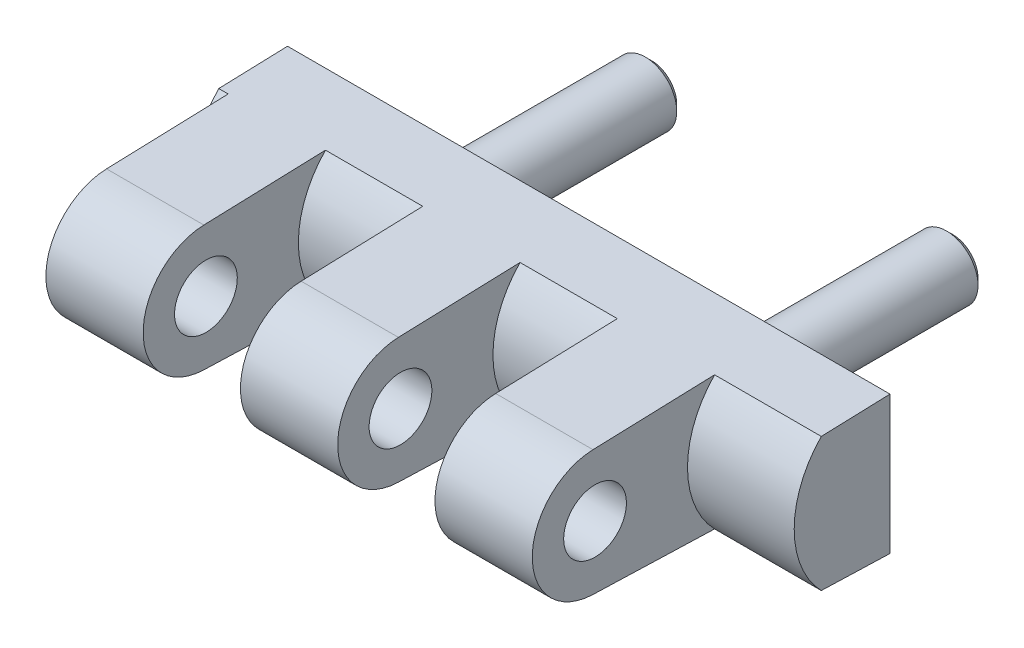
ISO-10303-21;
HEADER;
FILE_DESCRIPTION(('STEP AP214'),'2;1');
FILE_NAME('part.step','',(''),(''),'','','');
FILE_SCHEMA(('AUTOMOTIVE_DESIGN { 1 0 10303 214 1 1 1 1 }'));
ENDSEC;
DATA;
#1=APPLICATION_CONTEXT('core data for automotive mechanical design processes');
#2=APPLICATION_PROTOCOL_DEFINITION('international standard','automotive_design',2000,#1);
#3=PRODUCT_CONTEXT('',#1,'mechanical');
#4=PRODUCT('Part','Part','',(#3));
#5=PRODUCT_RELATED_PRODUCT_CATEGORY('part','',(#4));
#6=PRODUCT_DEFINITION_FORMATION('','',#4);
#7=PRODUCT_DEFINITION_CONTEXT('part definition',#1,'design');
#8=PRODUCT_DEFINITION('design','',#6,#7);
#9=PRODUCT_DEFINITION_SHAPE('','',#8);
#10=(LENGTH_UNIT() NAMED_UNIT(*) SI_UNIT(.MILLI.,.METRE.));
#11=(NAMED_UNIT(*) PLANE_ANGLE_UNIT() SI_UNIT($,.RADIAN.));
#12=(NAMED_UNIT(*) SI_UNIT($,.STERADIAN.) SOLID_ANGLE_UNIT());
#13=UNCERTAINTY_MEASURE_WITH_UNIT(LENGTH_MEASURE(1.E-05),#10,'distance_accuracy_value','');
#14=(GEOMETRIC_REPRESENTATION_CONTEXT(3) GLOBAL_UNCERTAINTY_ASSIGNED_CONTEXT((#13)) GLOBAL_UNIT_ASSIGNED_CONTEXT((#10,
#11,#12)) REPRESENTATION_CONTEXT('',''));
#15=CARTESIAN_POINT('',(0.,0.,0.));
#16=DIRECTION('',(0.,0.,1.));
#17=DIRECTION('',(1.,0.,0.));
#18=AXIS2_PLACEMENT_3D('',#15,#16,#17);
#19=CARTESIAN_POINT('',(36.25,-5.5,0.));
#20=DIRECTION('',(0.,-0.999450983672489,0.0331320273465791));
#21=DIRECTION('',(0.,0.0331320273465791,0.999450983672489));
#22=AXIS2_PLACEMENT_3D('',#19,#20,#21);
#23=PLANE('',#22);
#24=DIRECTION('',(-1.,0.,0.));
#25=VECTOR('',#24,1.);
#26=CARTESIAN_POINT('',(-11.755,-5.31847257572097,5.47590284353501));
#27=LINE('',#26,#25);
#28=CARTESIAN_POINT('',(-11.25,-5.31847257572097,5.47590284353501));
#29=VERTEX_POINT('',#28);
#30=CARTESIAN_POINT('',(-12.,-5.31847257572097,5.47590284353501));
#31=VERTEX_POINT('',#30);
#32=EDGE_CURVE('E135',#29,#31,#27,.T.);
#33=ORIENTED_EDGE('',*,*,#32,.T.);
#34=DIRECTION('',(0.,0.0331320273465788,0.999450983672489));
#35=VECTOR('',#34,1.);
#36=CARTESIAN_POINT('',(-12.,-5.5,0.));
#37=LINE('',#36,#35);
#38=CARTESIAN_POINT('',(-12.,-5.5,0.));
#39=VERTEX_POINT('',#38);
#40=EDGE_CURVE('E30',#39,#31,#37,.T.);
#41=ORIENTED_EDGE('',*,*,#40,.F.);
#42=DIRECTION('',(-1.,0.,0.));
#43=VECTOR('',#42,1.);
#44=CARTESIAN_POINT('',(36.25,-5.5,0.));
#45=LINE('',#44,#43);
#46=CARTESIAN_POINT('',(36.,-5.5,0.));
#47=VERTEX_POINT('',#46);
#48=EDGE_CURVE('E18',#39,#47,#45,.F.);
#49=ORIENTED_EDGE('',*,*,#48,.T.);
#50=DIRECTION('',(0.,-0.0331320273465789,-0.999450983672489));
#51=VECTOR('',#50,1.);
#52=CARTESIAN_POINT('',(36.,-5.31847257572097,5.47590284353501));
#53=LINE('',#52,#51);
#54=CARTESIAN_POINT('',(36.,-5.31847257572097,5.47590284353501));
#55=VERTEX_POINT('',#54);
#56=EDGE_CURVE('E562',#55,#47,#53,.T.);
#57=ORIENTED_EDGE('',*,*,#56,.F.);
#58=DIRECTION('',(1.,0.,0.));
#59=VECTOR('',#58,1.);
#60=CARTESIAN_POINT('',(36.25,-5.31847257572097,5.47590284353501));
#61=LINE('',#60,#59);
#62=CARTESIAN_POINT('',(27.5,-5.31847257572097,5.47590284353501));
#63=VERTEX_POINT('',#62);
#64=EDGE_CURVE('E253',#63,#55,#61,.T.);
#65=ORIENTED_EDGE('',*,*,#64,.F.);
#66=DIRECTION('',(0.,0.0331320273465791,0.999450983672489));
#67=VECTOR('',#66,1.);
#68=CARTESIAN_POINT('',(27.5,-5.5,0.));
#69=LINE('',#68,#67);
#70=CARTESIAN_POINT('',(27.5,-4.99725491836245,15.1656601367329));
#71=VERTEX_POINT('',#70);
#72=EDGE_CURVE('E261',#71,#63,#69,.F.);
#73=ORIENTED_EDGE('',*,*,#72,.F.);
#74=DIRECTION('',(1.,0.,0.));
#75=VECTOR('',#74,1.);
#76=CARTESIAN_POINT('',(36.25,-4.99725491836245,15.1656601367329));
#77=LINE('',#76,#75);
#78=CARTESIAN_POINT('',(19.75,-4.99725491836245,15.1656601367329));
#79=VERTEX_POINT('',#78);
#80=EDGE_CURVE('E259',#79,#71,#77,.T.);
#81=ORIENTED_EDGE('',*,*,#80,.F.);
#82=DIRECTION('',(0.,0.0331320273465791,0.999450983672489));
#83=VECTOR('',#82,1.);
#84=CARTESIAN_POINT('',(19.75,-5.5,0.));
#85=LINE('',#84,#83);
#86=CARTESIAN_POINT('',(19.75,-5.31847257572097,5.47590284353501));
#87=VERTEX_POINT('',#86);
#88=EDGE_CURVE('E262',#87,#79,#85,.T.);
#89=ORIENTED_EDGE('',*,*,#88,.F.);
#90=DIRECTION('',(1.,0.,0.));
#91=VECTOR('',#90,1.);
#92=CARTESIAN_POINT('',(36.25,-5.31847257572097,5.47590284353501));
#93=LINE('',#92,#91);
#94=CARTESIAN_POINT('',(12.,-5.31847257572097,5.47590284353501));
#95=VERTEX_POINT('',#94);
#96=EDGE_CURVE('E265',#95,#87,#93,.T.);
#97=ORIENTED_EDGE('',*,*,#96,.F.);
#98=DIRECTION('',(0.,0.0331320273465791,0.999450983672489));
#99=VECTOR('',#98,1.);
#100=CARTESIAN_POINT('',(12.,-5.5,0.));
#101=LINE('',#100,#99);
#102=CARTESIAN_POINT('',(12.,-4.99725491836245,15.1656601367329));
#103=VERTEX_POINT('',#102);
#104=EDGE_CURVE('E267',#103,#95,#101,.F.);
#105=ORIENTED_EDGE('',*,*,#104,.F.);
#106=DIRECTION('',(1.,0.,0.));
#107=VECTOR('',#106,1.);
#108=CARTESIAN_POINT('',(36.25,-4.99725491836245,15.1656601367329));
#109=LINE('',#108,#107);
#110=CARTESIAN_POINT('',(4.25,-4.99725491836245,15.1656601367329));
#111=VERTEX_POINT('',#110);
#112=EDGE_CURVE('E269',#111,#103,#109,.T.);
#113=ORIENTED_EDGE('',*,*,#112,.F.);
#114=DIRECTION('',(0.,0.0331320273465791,0.999450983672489));
#115=VECTOR('',#114,1.);
#116=CARTESIAN_POINT('',(4.25,-5.5,0.));
#117=LINE('',#116,#115);
#118=CARTESIAN_POINT('',(4.25,-5.31847257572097,5.47590284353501));
#119=VERTEX_POINT('',#118);
#120=EDGE_CURVE('E271',#119,#111,#117,.T.);
#121=ORIENTED_EDGE('',*,*,#120,.F.);
#122=DIRECTION('',(1.,0.,0.));
#123=VECTOR('',#122,1.);
#124=CARTESIAN_POINT('',(36.25,-5.31847257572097,5.47590284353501));
#125=LINE('',#124,#123);
#126=CARTESIAN_POINT('',(-3.5,-5.31847257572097,5.47590284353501));
#127=VERTEX_POINT('',#126);
#128=EDGE_CURVE('E273',#127,#119,#125,.T.);
#129=ORIENTED_EDGE('',*,*,#128,.F.);
#130=DIRECTION('',(0.,0.0331320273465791,0.999450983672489));
#131=VECTOR('',#130,1.);
#132=CARTESIAN_POINT('',(-3.5,-5.5,0.));
#133=LINE('',#132,#131);
#134=CARTESIAN_POINT('',(-3.5,-4.99725491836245,15.1656601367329));
#135=VERTEX_POINT('',#134);
#136=EDGE_CURVE('E275',#135,#127,#133,.F.);
#137=ORIENTED_EDGE('',*,*,#136,.F.);
#138=DIRECTION('',(1.,0.,0.));
#139=VECTOR('',#138,1.);
#140=CARTESIAN_POINT('',(36.25,-4.99725491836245,15.1656601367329));
#141=LINE('',#140,#139);
#142=CARTESIAN_POINT('',(-11.25,-4.99725491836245,15.1656601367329));
#143=VERTEX_POINT('',#142);
#144=EDGE_CURVE('E277',#143,#135,#141,.T.);
#145=ORIENTED_EDGE('',*,*,#144,.F.);
#146=DIRECTION('',(0.,0.0331320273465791,0.999450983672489));
#147=VECTOR('',#146,1.);
#148=CARTESIAN_POINT('',(-11.25,-5.5,0.));
#149=LINE('',#148,#147);
#150=EDGE_CURVE('E255',#29,#143,#149,.T.);
#151=ORIENTED_EDGE('',*,*,#150,.F.);
#152=EDGE_LOOP('',(#33,#41,#49,#57,#65,#73,#81,#89,#97,#105,#113,#121,#129,#137,#145,#151));
#153=FACE_BOUND('',#152,.T.);
#154=ADVANCED_FACE('F14',(#153),#23,.T.);
#155=CARTESIAN_POINT('',(36.25,4.99725491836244,15.1656601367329));
#156=DIRECTION('',(0.,0.999450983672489,0.0331320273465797));
#157=DIRECTION('',(0.,0.0331320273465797,-0.999450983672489));
#158=AXIS2_PLACEMENT_3D('',#155,#156,#157);
#159=PLANE('',#158);
#160=DIRECTION('',(-1.,0.,0.));
#161=VECTOR('',#160,1.);
#162=CARTESIAN_POINT('',(36.25,5.5,0.));
#163=LINE('',#162,#161);
#164=CARTESIAN_POINT('',(36.,5.5,0.));
#165=VERTEX_POINT('',#164);
#166=CARTESIAN_POINT('',(-12.,5.5,0.));
#167=VERTEX_POINT('',#166);
#168=EDGE_CURVE('E9',#165,#167,#163,.T.);
#169=ORIENTED_EDGE('',*,*,#168,.T.);
#170=DIRECTION('',(0.,0.0331320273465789,-0.999450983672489));
#171=VECTOR('',#170,1.);
#172=CARTESIAN_POINT('',(-12.,5.31847257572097,5.47590284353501));
#173=LINE('',#172,#171);
#174=CARTESIAN_POINT('',(-12.,5.31847257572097,5.47590284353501));
#175=VERTEX_POINT('',#174);
#176=EDGE_CURVE('E129',#175,#167,#173,.T.);
#177=ORIENTED_EDGE('',*,*,#176,.F.);
#178=DIRECTION('',(-1.,0.,0.));
#179=VECTOR('',#178,1.);
#180=CARTESIAN_POINT('',(-11.755,5.31847257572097,5.47590284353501));
#181=LINE('',#180,#179);
#182=CARTESIAN_POINT('',(-11.25,5.31847257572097,5.47590284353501));
#183=VERTEX_POINT('',#182);
#184=EDGE_CURVE('E211',#175,#183,#181,.F.);
#185=ORIENTED_EDGE('',*,*,#184,.T.);
#186=DIRECTION('',(0.,0.0331320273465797,-0.999450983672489));
#187=VECTOR('',#186,1.);
#188=CARTESIAN_POINT('',(-11.25,4.99725491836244,15.1656601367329));
#189=LINE('',#188,#187);
#190=CARTESIAN_POINT('',(-11.25,4.99725491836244,15.1656601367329));
#191=VERTEX_POINT('',#190);
#192=EDGE_CURVE('E148',#191,#183,#189,.T.);
#193=ORIENTED_EDGE('',*,*,#192,.F.);
#194=DIRECTION('',(1.,0.,0.));
#195=VECTOR('',#194,1.);
#196=CARTESIAN_POINT('',(36.25,4.99725491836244,15.1656601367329));
#197=LINE('',#196,#195);
#198=CARTESIAN_POINT('',(-3.5,4.99725491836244,15.1656601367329));
#199=VERTEX_POINT('',#198);
#200=EDGE_CURVE('E221',#199,#191,#197,.F.);
#201=ORIENTED_EDGE('',*,*,#200,.F.);
#202=DIRECTION('',(0.,0.0331320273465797,-0.999450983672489));
#203=VECTOR('',#202,1.);
#204=CARTESIAN_POINT('',(-3.5,4.99725491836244,15.1656601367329));
#205=LINE('',#204,#203);
#206=CARTESIAN_POINT('',(-3.5,5.31847257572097,5.47590284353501));
#207=VERTEX_POINT('',#206);
#208=EDGE_CURVE('E224',#207,#199,#205,.F.);
#209=ORIENTED_EDGE('',*,*,#208,.F.);
#210=DIRECTION('',(1.,0.,0.));
#211=VECTOR('',#210,1.);
#212=CARTESIAN_POINT('',(36.25,5.31847257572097,5.47590284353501));
#213=LINE('',#212,#211);
#214=CARTESIAN_POINT('',(4.25,5.31847257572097,5.47590284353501));
#215=VERTEX_POINT('',#214);
#216=EDGE_CURVE('E229',#215,#207,#213,.F.);
#217=ORIENTED_EDGE('',*,*,#216,.F.);
#218=DIRECTION('',(0.,0.0331320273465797,-0.999450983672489));
#219=VECTOR('',#218,1.);
#220=CARTESIAN_POINT('',(4.25,4.99725491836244,15.1656601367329));
#221=LINE('',#220,#219);
#222=CARTESIAN_POINT('',(4.25,4.99725491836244,15.1656601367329));
#223=VERTEX_POINT('',#222);
#224=EDGE_CURVE('E232',#223,#215,#221,.T.);
#225=ORIENTED_EDGE('',*,*,#224,.F.);
#226=DIRECTION('',(1.,0.,0.));
#227=VECTOR('',#226,1.);
#228=CARTESIAN_POINT('',(36.25,4.99725491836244,15.1656601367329));
#229=LINE('',#228,#227);
#230=CARTESIAN_POINT('',(12.,4.99725491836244,15.1656601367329));
#231=VERTEX_POINT('',#230);
#232=EDGE_CURVE('E235',#231,#223,#229,.F.);
#233=ORIENTED_EDGE('',*,*,#232,.F.);
#234=DIRECTION('',(0.,0.0331320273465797,-0.999450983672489));
#235=VECTOR('',#234,1.);
#236=CARTESIAN_POINT('',(12.,4.99725491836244,15.1656601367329));
#237=LINE('',#236,#235);
#238=CARTESIAN_POINT('',(12.,5.31847257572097,5.47590284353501));
#239=VERTEX_POINT('',#238);
#240=EDGE_CURVE('E238',#239,#231,#237,.F.);
#241=ORIENTED_EDGE('',*,*,#240,.F.);
#242=DIRECTION('',(1.,0.,0.));
#243=VECTOR('',#242,1.);
#244=CARTESIAN_POINT('',(36.25,5.31847257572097,5.47590284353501));
#245=LINE('',#244,#243);
#246=CARTESIAN_POINT('',(19.75,5.31847257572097,5.47590284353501));
#247=VERTEX_POINT('',#246);
#248=EDGE_CURVE('E241',#247,#239,#245,.F.);
#249=ORIENTED_EDGE('',*,*,#248,.F.);
#250=DIRECTION('',(0.,0.0331320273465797,-0.999450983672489));
#251=VECTOR('',#250,1.);
#252=CARTESIAN_POINT('',(19.75,4.99725491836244,15.1656601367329));
#253=LINE('',#252,#251);
#254=CARTESIAN_POINT('',(19.75,4.99725491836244,15.1656601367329));
#255=VERTEX_POINT('',#254);
#256=EDGE_CURVE('E244',#255,#247,#253,.T.);
#257=ORIENTED_EDGE('',*,*,#256,.F.);
#258=DIRECTION('',(1.,0.,0.));
#259=VECTOR('',#258,1.);
#260=CARTESIAN_POINT('',(36.25,4.99725491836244,15.1656601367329));
#261=LINE('',#260,#259);
#262=CARTESIAN_POINT('',(27.5,4.99725491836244,15.1656601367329));
#263=VERTEX_POINT('',#262);
#264=EDGE_CURVE('E247',#263,#255,#261,.F.);
#265=ORIENTED_EDGE('',*,*,#264,.F.);
#266=DIRECTION('',(0.,0.0331320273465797,-0.999450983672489));
#267=VECTOR('',#266,1.);
#268=CARTESIAN_POINT('',(27.5,4.99725491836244,15.1656601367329));
#269=LINE('',#268,#267);
#270=CARTESIAN_POINT('',(27.5,5.31847257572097,5.47590284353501));
#271=VERTEX_POINT('',#270);
#272=EDGE_CURVE('E250',#271,#263,#269,.F.);
#273=ORIENTED_EDGE('',*,*,#272,.F.);
#274=DIRECTION('',(1.,0.,0.));
#275=VECTOR('',#274,1.);
#276=CARTESIAN_POINT('',(36.25,5.31847257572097,5.47590284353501));
#277=LINE('',#276,#275);
#278=CARTESIAN_POINT('',(36.,5.31847257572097,5.47590284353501));
#279=VERTEX_POINT('',#278);
#280=EDGE_CURVE('E219',#279,#271,#277,.F.);
#281=ORIENTED_EDGE('',*,*,#280,.F.);
#282=DIRECTION('',(0.,-0.0331320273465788,0.999450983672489));
#283=VECTOR('',#282,1.);
#284=CARTESIAN_POINT('',(36.,5.5,0.));
#285=LINE('',#284,#283);
#286=EDGE_CURVE('E567',#165,#279,#285,.T.);
#287=ORIENTED_EDGE('',*,*,#286,.F.);
#288=EDGE_LOOP('',(#169,#177,#185,#193,#201,#209,#217,#225,#233,#241,#249,#257,#265,#273,#281,#287));
#289=FACE_BOUND('',#288,.T.);
#290=ADVANCED_FACE('F299',(#289),#159,.T.);
#291=CARTESIAN_POINT('',(36.25,5.5,0.));
#292=DIRECTION('',(0.,0.,-1.));
#293=DIRECTION('',(-1.,0.,0.));
#294=AXIS2_PLACEMENT_3D('',#291,#292,#293);
#295=PLANE('',#294);
#296=CARTESIAN_POINT('',(24.,0.,0.));
#297=DIRECTION('',(0.,0.,1.));
#298=DIRECTION('',(-1.,0.,0.));
#299=AXIS2_PLACEMENT_3D('',#296,#297,#298);
#300=CIRCLE('',#299,2.5);
#301=CARTESIAN_POINT('',(21.5,0.,0.));
#302=VERTEX_POINT('',#301);
#303=EDGE_CURVE('E141',#302,#302,#300,.F.);
#304=ORIENTED_EDGE('',*,*,#303,.F.);
#305=EDGE_LOOP('',(#304));
#306=FACE_BOUND('',#305,.T.);
#307=CARTESIAN_POINT('',(0.,0.,0.));
#308=DIRECTION('',(0.,0.,1.));
#309=DIRECTION('',(-1.,0.,0.));
#310=AXIS2_PLACEMENT_3D('',#307,#308,#309);
#311=CIRCLE('',#310,2.5);
#312=CARTESIAN_POINT('',(-2.5,0.,0.));
#313=VERTEX_POINT('',#312);
#314=EDGE_CURVE('E143',#313,#313,#311,.F.);
#315=ORIENTED_EDGE('',*,*,#314,.F.);
#316=EDGE_LOOP('',(#315));
#317=FACE_BOUND('',#316,.T.);
#318=ORIENTED_EDGE('',*,*,#48,.F.);
#319=DIRECTION('',(0.,-1.,0.));
#320=VECTOR('',#319,1.);
#321=CARTESIAN_POINT('',(-12.,5.5,0.));
#322=LINE('',#321,#320);
#323=EDGE_CURVE('E126',#167,#39,#322,.T.);
#324=ORIENTED_EDGE('',*,*,#323,.F.);
#325=ORIENTED_EDGE('',*,*,#168,.F.);
#326=DIRECTION('',(0.,1.,0.));
#327=VECTOR('',#326,1.);
#328=CARTESIAN_POINT('',(36.,-5.5,0.));
#329=LINE('',#328,#327);
#330=EDGE_CURVE('E140',#47,#165,#329,.T.);
#331=ORIENTED_EDGE('',*,*,#330,.F.);
#332=EDGE_LOOP('',(#318,#324,#325,#331));
#333=FACE_BOUND('',#332,.T.);
#334=ADVANCED_FACE('F139',(#306,#317,#333),#295,.T.);
#335=CARTESIAN_POINT('',(-11.755,0.,0.));
#336=DIRECTION('',(-1.,0.,0.));
#337=DIRECTION('',(0.,1.,0.));
#338=AXIS2_PLACEMENT_3D('',#335,#336,#337);
#339=CYLINDRICAL_SURFACE('',#338,7.63358778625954);
#340=ORIENTED_EDGE('',*,*,#184,.F.);
#341=CARTESIAN_POINT('',(-12.,0.,0.));
#342=DIRECTION('',(-1.,0.,0.));
#343=DIRECTION('',(0.,0.,1.));
#344=AXIS2_PLACEMENT_3D('',#341,#342,#343);
#345=CIRCLE('',#344,7.63358778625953);
#346=EDGE_CURVE('E136',#31,#175,#345,.T.);
#347=ORIENTED_EDGE('',*,*,#346,.F.);
#348=ORIENTED_EDGE('',*,*,#32,.F.);
#349=CARTESIAN_POINT('',(-11.25,0.,0.));
#350=DIRECTION('',(1.,0.,0.));
#351=DIRECTION('',(0.,1.,0.));
#352=AXIS2_PLACEMENT_3D('',#349,#350,#351);
#353=CIRCLE('',#352,7.63358778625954);
#354=EDGE_CURVE('E157',#183,#29,#353,.T.);
#355=ORIENTED_EDGE('',*,*,#354,.F.);
#356=EDGE_LOOP('',(#340,#347,#348,#355));
#357=FACE_BOUND('',#356,.T.);
#358=ADVANCED_FACE('F298',(#357),#339,.T.);
#359=CARTESIAN_POINT('',(31.88,0.,0.));
#360=DIRECTION('',(-1.,0.,0.));
#361=DIRECTION('',(0.,1.,0.));
#362=AXIS2_PLACEMENT_3D('',#359,#360,#361);
#363=CYLINDRICAL_SURFACE('',#362,7.63358778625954);
#364=ORIENTED_EDGE('',*,*,#64,.T.);
#365=CARTESIAN_POINT('',(36.,0.,0.));
#366=DIRECTION('',(1.,0.,0.));
#367=DIRECTION('',(0.,0.,-1.));
#368=AXIS2_PLACEMENT_3D('',#365,#366,#367);
#369=CIRCLE('',#368,7.63358778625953);
#370=EDGE_CURVE('E214',#279,#55,#369,.T.);
#371=ORIENTED_EDGE('',*,*,#370,.F.);
#372=ORIENTED_EDGE('',*,*,#280,.T.);
#373=CARTESIAN_POINT('',(27.5,0.,0.));
#374=DIRECTION('',(1.,0.,0.));
#375=DIRECTION('',(0.,1.,0.));
#376=AXIS2_PLACEMENT_3D('',#373,#374,#375);
#377=CIRCLE('',#376,7.63358778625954);
#378=EDGE_CURVE('E202',#63,#271,#377,.F.);
#379=ORIENTED_EDGE('',*,*,#378,.F.);
#380=EDGE_LOOP('',(#364,#371,#372,#379));
#381=FACE_BOUND('',#380,.T.);
#382=ADVANCED_FACE('F308',(#381),#363,.T.);
#383=CARTESIAN_POINT('',(-1.00475,0.,-17.));
#384=DIRECTION('',(0.,0.,-1.));
#385=DIRECTION('',(-1.,0.,0.));
#386=AXIS2_PLACEMENT_3D('',#383,#384,#385);
#387=PLANE('',#386);
#388=CARTESIAN_POINT('',(0.,0.,-17.0000000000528));
#389=DIRECTION('',(0.,0.,-1.));
#390=DIRECTION('',(1.,0.,0.));
#391=AXIS2_PLACEMENT_3D('',#388,#389,#390);
#392=CIRCLE('',#391,2.00950000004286);
#393=CARTESIAN_POINT('',(2.00950000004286,0.,-17.0000000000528));
#394=VERTEX_POINT('',#393);
#395=EDGE_CURVE('E212',#394,#394,#392,.T.);
#396=ORIENTED_EDGE('',*,*,#395,.T.);
#397=EDGE_LOOP('',(#396));
#398=FACE_BOUND('',#397,.T.);
#399=ADVANCED_FACE('F16',(#398),#387,.T.);
#400=CARTESIAN_POINT('',(22.99525,0.,-17.));
#401=DIRECTION('',(0.,0.,-1.));
#402=DIRECTION('',(-1.,0.,0.));
#403=AXIS2_PLACEMENT_3D('',#400,#401,#402);
#404=PLANE('',#403);
#405=CARTESIAN_POINT('',(24.,0.,-16.9999999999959));
#406=DIRECTION('',(0.,0.,-1.));
#407=DIRECTION('',(1.,0.,0.));
#408=AXIS2_PLACEMENT_3D('',#405,#406,#407);
#409=CIRCLE('',#408,2.00950000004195);
#410=CARTESIAN_POINT('',(26.009500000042,0.,-16.9999999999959));
#411=VERTEX_POINT('',#410);
#412=EDGE_CURVE('E208',#411,#411,#409,.T.);
#413=ORIENTED_EDGE('',*,*,#412,.T.);
#414=EDGE_LOOP('',(#413));
#415=FACE_BOUND('',#414,.T.);
#416=ADVANCED_FACE('F387',(#415),#404,.T.);
#417=CARTESIAN_POINT('',(36.25,0.,15.));
#418=DIRECTION('',(1.,0.,0.));
#419=DIRECTION('',(0.,-1.,0.));
#420=AXIS2_PLACEMENT_3D('',#417,#418,#419);
#421=CYLINDRICAL_SURFACE('',#420,2.5);
#422=CARTESIAN_POINT('',(19.75,0.,15.));
#423=DIRECTION('',(-1.,0.,0.));
#424=DIRECTION('',(0.,-1.,0.));
#425=AXIS2_PLACEMENT_3D('',#422,#423,#424);
#426=CIRCLE('',#425,2.5);
#427=CARTESIAN_POINT('',(19.75,-2.5,15.));
#428=VERTEX_POINT('',#427);
#429=EDGE_CURVE('E196',#428,#428,#426,.F.);
#430=ORIENTED_EDGE('',*,*,#429,.F.);
#431=EDGE_LOOP('',(#430));
#432=FACE_BOUND('',#431,.T.);
#433=CARTESIAN_POINT('',(27.5,0.,15.));
#434=DIRECTION('',(-1.,0.,0.));
#435=DIRECTION('',(0.,-1.,0.));
#436=AXIS2_PLACEMENT_3D('',#433,#434,#435);
#437=CIRCLE('',#436,2.5);
#438=CARTESIAN_POINT('',(27.5,-2.5,15.));
#439=VERTEX_POINT('',#438);
#440=EDGE_CURVE('E205',#439,#439,#437,.T.);
#441=ORIENTED_EDGE('',*,*,#440,.F.);
#442=EDGE_LOOP('',(#441));
#443=FACE_BOUND('',#442,.T.);
#444=ADVANCED_FACE('F384',(#432,#443),#421,.F.);
#445=CARTESIAN_POINT('',(36.25,0.,15.));
#446=DIRECTION('',(1.,0.,0.));
#447=DIRECTION('',(0.,-1.,0.));
#448=AXIS2_PLACEMENT_3D('',#445,#446,#447);
#449=CYLINDRICAL_SURFACE('',#448,2.5);
#450=CARTESIAN_POINT('',(4.25,0.,15.));
#451=DIRECTION('',(-1.,0.,0.));
#452=DIRECTION('',(0.,-1.,0.));
#453=AXIS2_PLACEMENT_3D('',#450,#451,#452);
#454=CIRCLE('',#453,2.5);
#455=CARTESIAN_POINT('',(4.25,-2.5,15.));
#456=VERTEX_POINT('',#455);
#457=EDGE_CURVE('E178',#456,#456,#454,.F.);
#458=ORIENTED_EDGE('',*,*,#457,.F.);
#459=EDGE_LOOP('',(#458));
#460=FACE_BOUND('',#459,.T.);
#461=CARTESIAN_POINT('',(12.,0.,15.));
#462=DIRECTION('',(-1.,0.,0.));
#463=DIRECTION('',(0.,-1.,0.));
#464=AXIS2_PLACEMENT_3D('',#461,#462,#463);
#465=CIRCLE('',#464,2.5);
#466=CARTESIAN_POINT('',(12.,-2.5,15.));
#467=VERTEX_POINT('',#466);
#468=EDGE_CURVE('E187',#467,#467,#465,.T.);
#469=ORIENTED_EDGE('',*,*,#468,.F.);
#470=EDGE_LOOP('',(#469));
#471=FACE_BOUND('',#470,.T.);
#472=ADVANCED_FACE('F380',(#460,#471),#449,.F.);
#473=CARTESIAN_POINT('',(36.25,0.,15.));
#474=DIRECTION('',(1.,0.,0.));
#475=DIRECTION('',(0.,-1.,0.));
#476=AXIS2_PLACEMENT_3D('',#473,#474,#475);
#477=CYLINDRICAL_SURFACE('',#476,2.5);
#478=CARTESIAN_POINT('',(-11.25,0.,15.));
#479=DIRECTION('',(-1.,0.,0.));
#480=DIRECTION('',(0.,-1.,0.));
#481=AXIS2_PLACEMENT_3D('',#478,#479,#480);
#482=CIRCLE('',#481,2.5);
#483=CARTESIAN_POINT('',(-11.25,-2.5,15.));
#484=VERTEX_POINT('',#483);
#485=EDGE_CURVE('E160',#484,#484,#482,.F.);
#486=ORIENTED_EDGE('',*,*,#485,.F.);
#487=EDGE_LOOP('',(#486));
#488=FACE_BOUND('',#487,.T.);
#489=CARTESIAN_POINT('',(-3.5,0.,15.));
#490=DIRECTION('',(-1.,0.,0.));
#491=DIRECTION('',(0.,-1.,0.));
#492=AXIS2_PLACEMENT_3D('',#489,#490,#491);
#493=CIRCLE('',#492,2.5);
#494=CARTESIAN_POINT('',(-3.5,-2.5,15.));
#495=VERTEX_POINT('',#494);
#496=EDGE_CURVE('E169',#495,#495,#493,.T.);
#497=ORIENTED_EDGE('',*,*,#496,.F.);
#498=EDGE_LOOP('',(#497));
#499=FACE_BOUND('',#498,.T.);
#500=ADVANCED_FACE('F376',(#488,#499),#477,.F.);
#501=CARTESIAN_POINT('',(0.,0.,-16.5095000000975));
#502=DIRECTION('',(0.,0.,1.));
#503=DIRECTION('',(1.,0.,0.));
#504=AXIS2_PLACEMENT_3D('',#501,#502,#503);
#505=CONICAL_SURFACE('',#504,2.49999999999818,0.785398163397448);
#506=ORIENTED_EDGE('',*,*,#395,.F.);
#507=EDGE_LOOP('',(#506));
#508=FACE_BOUND('',#507,.T.);
#509=CARTESIAN_POINT('',(0.,0.,-16.5095));
#510=DIRECTION('',(0.,0.,1.));
#511=DIRECTION('',(-1.,0.,0.));
#512=AXIS2_PLACEMENT_3D('',#509,#510,#511);
#513=CIRCLE('',#512,2.5);
#514=CARTESIAN_POINT('',(-2.5,0.,-16.5095));
#515=VERTEX_POINT('',#514);
#516=EDGE_CURVE('E151',#515,#515,#513,.F.);
#517=ORIENTED_EDGE('',*,*,#516,.T.);
#518=EDGE_LOOP('',(#517));
#519=FACE_BOUND('',#518,.T.);
#520=ADVANCED_FACE('F287',(#508,#519),#505,.T.);
#521=CARTESIAN_POINT('',(24.,0.,-16.5095000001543));
#522=DIRECTION('',(0.,0.,1.));
#523=DIRECTION('',(1.,0.,0.));
#524=AXIS2_PLACEMENT_3D('',#521,#522,#523);
#525=CONICAL_SURFACE('',#524,2.49999999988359,0.785398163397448);
#526=ORIENTED_EDGE('',*,*,#412,.F.);
#527=EDGE_LOOP('',(#526));
#528=FACE_BOUND('',#527,.T.);
#529=CARTESIAN_POINT('',(24.,0.,-16.5095));
#530=DIRECTION('',(0.,0.,1.));
#531=DIRECTION('',(-1.,0.,0.));
#532=AXIS2_PLACEMENT_3D('',#529,#530,#531);
#533=CIRCLE('',#532,2.5);
#534=CARTESIAN_POINT('',(21.5,0.,-16.5095));
#535=VERTEX_POINT('',#534);
#536=EDGE_CURVE('E256',#535,#535,#533,.F.);
#537=ORIENTED_EDGE('',*,*,#536,.T.);
#538=EDGE_LOOP('',(#537));
#539=FACE_BOUND('',#538,.T.);
#540=ADVANCED_FACE('F366',(#528,#539),#525,.T.);
#541=CARTESIAN_POINT('',(27.5,-15.8167938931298,0.));
#542=DIRECTION('',(-1.,0.,0.));
#543=DIRECTION('',(0.,1.,0.));
#544=AXIS2_PLACEMENT_3D('',#541,#542,#543);
#545=PLANE('',#544);
#546=ORIENTED_EDGE('',*,*,#378,.T.);
#547=ORIENTED_EDGE('',*,*,#272,.T.);
#548=CARTESIAN_POINT('',(27.5,0.,15.));
#549=DIRECTION('',(-1.,0.,0.));
#550=DIRECTION('',(0.,-1.,0.));
#551=AXIS2_PLACEMENT_3D('',#548,#549,#550);
#552=CIRCLE('',#551,5.);
#553=EDGE_CURVE('E199',#263,#71,#552,.F.);
#554=ORIENTED_EDGE('',*,*,#553,.T.);
#555=ORIENTED_EDGE('',*,*,#72,.T.);
#556=EDGE_LOOP('',(#546,#547,#554,#555));
#557=FACE_BOUND('',#556,.T.);
#558=ORIENTED_EDGE('',*,*,#440,.T.);
#559=EDGE_LOOP('',(#558));
#560=FACE_BOUND('',#559,.T.);
#561=ADVANCED_FACE('F362',(#557,#560),#545,.F.);
#562=CARTESIAN_POINT('',(36.25,0.,15.));
#563=DIRECTION('',(1.,0.,0.));
#564=DIRECTION('',(0.,-1.,0.));
#565=AXIS2_PLACEMENT_3D('',#562,#563,#564);
#566=CYLINDRICAL_SURFACE('',#565,5.);
#567=CARTESIAN_POINT('',(19.75,0.,15.));
#568=DIRECTION('',(-1.,0.,0.));
#569=DIRECTION('',(0.,-1.,0.));
#570=AXIS2_PLACEMENT_3D('',#567,#568,#569);
#571=CIRCLE('',#570,5.);
#572=EDGE_CURVE('E193',#79,#255,#571,.T.);
#573=ORIENTED_EDGE('',*,*,#572,.F.);
#574=ORIENTED_EDGE('',*,*,#80,.T.);
#575=ORIENTED_EDGE('',*,*,#553,.F.);
#576=ORIENTED_EDGE('',*,*,#264,.T.);
#577=EDGE_LOOP('',(#573,#574,#575,#576));
#578=FACE_BOUND('',#577,.T.);
#579=ADVANCED_FACE('F358',(#578),#566,.T.);
#580=CARTESIAN_POINT('',(19.75,-15.8167938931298,0.));
#581=DIRECTION('',(1.,0.,0.));
#582=DIRECTION('',(0.,-1.,0.));
#583=AXIS2_PLACEMENT_3D('',#580,#581,#582);
#584=PLANE('',#583);
#585=ORIENTED_EDGE('',*,*,#572,.T.);
#586=ORIENTED_EDGE('',*,*,#256,.T.);
#587=CARTESIAN_POINT('',(19.75,0.,0.));
#588=DIRECTION('',(1.,0.,0.));
#589=DIRECTION('',(0.,1.,0.));
#590=AXIS2_PLACEMENT_3D('',#587,#588,#589);
#591=CIRCLE('',#590,7.63358778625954);
#592=EDGE_CURVE('E190',#247,#87,#591,.T.);
#593=ORIENTED_EDGE('',*,*,#592,.T.);
#594=ORIENTED_EDGE('',*,*,#88,.T.);
#595=EDGE_LOOP('',(#585,#586,#593,#594));
#596=FACE_BOUND('',#595,.T.);
#597=ORIENTED_EDGE('',*,*,#429,.T.);
#598=EDGE_LOOP('',(#597));
#599=FACE_BOUND('',#598,.T.);
#600=ADVANCED_FACE('F354',(#596,#599),#584,.F.);
#601=CARTESIAN_POINT('',(15.875,0.,0.));
#602=DIRECTION('',(-1.,0.,0.));
#603=DIRECTION('',(0.,1.,0.));
#604=AXIS2_PLACEMENT_3D('',#601,#602,#603);
#605=CYLINDRICAL_SURFACE('',#604,7.63358778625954);
#606=ORIENTED_EDGE('',*,*,#96,.T.);
#607=ORIENTED_EDGE('',*,*,#592,.F.);
#608=ORIENTED_EDGE('',*,*,#248,.T.);
#609=CARTESIAN_POINT('',(12.,0.,0.));
#610=DIRECTION('',(1.,0.,0.));
#611=DIRECTION('',(0.,1.,0.));
#612=AXIS2_PLACEMENT_3D('',#609,#610,#611);
#613=CIRCLE('',#612,7.63358778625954);
#614=EDGE_CURVE('E184',#95,#239,#613,.F.);
#615=ORIENTED_EDGE('',*,*,#614,.F.);
#616=EDGE_LOOP('',(#606,#607,#608,#615));
#617=FACE_BOUND('',#616,.T.);
#618=ADVANCED_FACE('F350',(#617),#605,.T.);
#619=CARTESIAN_POINT('',(12.,-15.8167938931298,0.));
#620=DIRECTION('',(-1.,0.,0.));
#621=DIRECTION('',(0.,1.,0.));
#622=AXIS2_PLACEMENT_3D('',#619,#620,#621);
#623=PLANE('',#622);
#624=ORIENTED_EDGE('',*,*,#614,.T.);
#625=ORIENTED_EDGE('',*,*,#240,.T.);
#626=CARTESIAN_POINT('',(12.,0.,15.));
#627=DIRECTION('',(-1.,0.,0.));
#628=DIRECTION('',(0.,-1.,0.));
#629=AXIS2_PLACEMENT_3D('',#626,#627,#628);
#630=CIRCLE('',#629,5.);
#631=EDGE_CURVE('E181',#231,#103,#630,.F.);
#632=ORIENTED_EDGE('',*,*,#631,.T.);
#633=ORIENTED_EDGE('',*,*,#104,.T.);
#634=EDGE_LOOP('',(#624,#625,#632,#633));
#635=FACE_BOUND('',#634,.T.);
#636=ORIENTED_EDGE('',*,*,#468,.T.);
#637=EDGE_LOOP('',(#636));
#638=FACE_BOUND('',#637,.T.);
#639=ADVANCED_FACE('F346',(#635,#638),#623,.F.);
#640=CARTESIAN_POINT('',(36.25,0.,15.));
#641=DIRECTION('',(1.,0.,0.));
#642=DIRECTION('',(0.,-1.,0.));
#643=AXIS2_PLACEMENT_3D('',#640,#641,#642);
#644=CYLINDRICAL_SURFACE('',#643,5.);
#645=CARTESIAN_POINT('',(4.25,0.,15.));
#646=DIRECTION('',(-1.,0.,0.));
#647=DIRECTION('',(0.,-1.,0.));
#648=AXIS2_PLACEMENT_3D('',#645,#646,#647);
#649=CIRCLE('',#648,5.);
#650=EDGE_CURVE('E175',#111,#223,#649,.T.);
#651=ORIENTED_EDGE('',*,*,#650,.F.);
#652=ORIENTED_EDGE('',*,*,#112,.T.);
#653=ORIENTED_EDGE('',*,*,#631,.F.);
#654=ORIENTED_EDGE('',*,*,#232,.T.);
#655=EDGE_LOOP('',(#651,#652,#653,#654));
#656=FACE_BOUND('',#655,.T.);
#657=ADVANCED_FACE('F342',(#656),#644,.T.);
#658=CARTESIAN_POINT('',(4.25,-15.8167938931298,0.));
#659=DIRECTION('',(1.,0.,0.));
#660=DIRECTION('',(0.,-1.,0.));
#661=AXIS2_PLACEMENT_3D('',#658,#659,#660);
#662=PLANE('',#661);
#663=ORIENTED_EDGE('',*,*,#650,.T.);
#664=ORIENTED_EDGE('',*,*,#224,.T.);
#665=CARTESIAN_POINT('',(4.25,0.,0.));
#666=DIRECTION('',(1.,0.,0.));
#667=DIRECTION('',(0.,1.,0.));
#668=AXIS2_PLACEMENT_3D('',#665,#666,#667);
#669=CIRCLE('',#668,7.63358778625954);
#670=EDGE_CURVE('E172',#215,#119,#669,.T.);
#671=ORIENTED_EDGE('',*,*,#670,.T.);
#672=ORIENTED_EDGE('',*,*,#120,.T.);
#673=EDGE_LOOP('',(#663,#664,#671,#672));
#674=FACE_BOUND('',#673,.T.);
#675=ORIENTED_EDGE('',*,*,#457,.T.);
#676=EDGE_LOOP('',(#675));
#677=FACE_BOUND('',#676,.T.);
#678=ADVANCED_FACE('F338',(#674,#677),#662,.F.);
#679=CARTESIAN_POINT('',(0.375,0.,0.));
#680=DIRECTION('',(-1.,0.,0.));
#681=DIRECTION('',(0.,1.,0.));
#682=AXIS2_PLACEMENT_3D('',#679,#680,#681);
#683=CYLINDRICAL_SURFACE('',#682,7.63358778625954);
#684=ORIENTED_EDGE('',*,*,#128,.T.);
#685=ORIENTED_EDGE('',*,*,#670,.F.);
#686=ORIENTED_EDGE('',*,*,#216,.T.);
#687=CARTESIAN_POINT('',(-3.5,0.,0.));
#688=DIRECTION('',(1.,0.,0.));
#689=DIRECTION('',(0.,1.,0.));
#690=AXIS2_PLACEMENT_3D('',#687,#688,#689);
#691=CIRCLE('',#690,7.63358778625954);
#692=EDGE_CURVE('E166',#127,#207,#691,.F.);
#693=ORIENTED_EDGE('',*,*,#692,.F.);
#694=EDGE_LOOP('',(#684,#685,#686,#693));
#695=FACE_BOUND('',#694,.T.);
#696=ADVANCED_FACE('F334',(#695),#683,.T.);
#697=CARTESIAN_POINT('',(-3.5,-15.8167938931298,0.));
#698=DIRECTION('',(-1.,0.,0.));
#699=DIRECTION('',(0.,1.,0.));
#700=AXIS2_PLACEMENT_3D('',#697,#698,#699);
#701=PLANE('',#700);
#702=ORIENTED_EDGE('',*,*,#692,.T.);
#703=ORIENTED_EDGE('',*,*,#208,.T.);
#704=CARTESIAN_POINT('',(-3.5,0.,15.));
#705=DIRECTION('',(-1.,0.,0.));
#706=DIRECTION('',(0.,-1.,0.));
#707=AXIS2_PLACEMENT_3D('',#704,#705,#706);
#708=CIRCLE('',#707,5.);
#709=EDGE_CURVE('E163',#199,#135,#708,.F.);
#710=ORIENTED_EDGE('',*,*,#709,.T.);
#711=ORIENTED_EDGE('',*,*,#136,.T.);
#712=EDGE_LOOP('',(#702,#703,#710,#711));
#713=FACE_BOUND('',#712,.T.);
#714=ORIENTED_EDGE('',*,*,#496,.T.);
#715=EDGE_LOOP('',(#714));
#716=FACE_BOUND('',#715,.T.);
#717=ADVANCED_FACE('F330',(#713,#716),#701,.F.);
#718=CARTESIAN_POINT('',(36.25,0.,15.));
#719=DIRECTION('',(1.,0.,0.));
#720=DIRECTION('',(0.,-1.,0.));
#721=AXIS2_PLACEMENT_3D('',#718,#719,#720);
#722=CYLINDRICAL_SURFACE('',#721,5.);
#723=CARTESIAN_POINT('',(-11.25,0.,15.));
#724=DIRECTION('',(-1.,0.,0.));
#725=DIRECTION('',(0.,-1.,0.));
#726=AXIS2_PLACEMENT_3D('',#723,#724,#725);
#727=CIRCLE('',#726,5.);
#728=EDGE_CURVE('E154',#143,#191,#727,.T.);
#729=ORIENTED_EDGE('',*,*,#728,.F.);
#730=ORIENTED_EDGE('',*,*,#144,.T.);
#731=ORIENTED_EDGE('',*,*,#709,.F.);
#732=ORIENTED_EDGE('',*,*,#200,.T.);
#733=EDGE_LOOP('',(#729,#730,#731,#732));
#734=FACE_BOUND('',#733,.T.);
#735=ADVANCED_FACE('F326',(#734),#722,.T.);
#736=CARTESIAN_POINT('',(-11.25,-15.8167938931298,0.));
#737=DIRECTION('',(1.,0.,0.));
#738=DIRECTION('',(0.,-1.,0.));
#739=AXIS2_PLACEMENT_3D('',#736,#737,#738);
#740=PLANE('',#739);
#741=ORIENTED_EDGE('',*,*,#728,.T.);
#742=ORIENTED_EDGE('',*,*,#192,.T.);
#743=ORIENTED_EDGE('',*,*,#354,.T.);
#744=ORIENTED_EDGE('',*,*,#150,.T.);
#745=EDGE_LOOP('',(#741,#742,#743,#744));
#746=FACE_BOUND('',#745,.T.);
#747=ORIENTED_EDGE('',*,*,#485,.T.);
#748=EDGE_LOOP('',(#747));
#749=FACE_BOUND('',#748,.T.);
#750=ADVANCED_FACE('F293',(#746,#749),#740,.F.);
#751=CARTESIAN_POINT('',(0.,0.,-7.75475));
#752=DIRECTION('',(0.,0.,-1.));
#753=DIRECTION('',(-1.,0.,0.));
#754=AXIS2_PLACEMENT_3D('',#751,#752,#753);
#755=CYLINDRICAL_SURFACE('',#754,2.5);
#756=ORIENTED_EDGE('',*,*,#516,.F.);
#757=EDGE_LOOP('',(#756));
#758=FACE_BOUND('',#757,.T.);
#759=ORIENTED_EDGE('',*,*,#314,.T.);
#760=EDGE_LOOP('',(#759));
#761=FACE_BOUND('',#760,.T.);
#762=ADVANCED_FACE('F289',(#758,#761),#755,.T.);
#763=CARTESIAN_POINT('',(24.,0.,-7.75475));
#764=DIRECTION('',(0.,0.,-1.));
#765=DIRECTION('',(-1.,0.,0.));
#766=AXIS2_PLACEMENT_3D('',#763,#764,#765);
#767=CYLINDRICAL_SURFACE('',#766,2.5);
#768=ORIENTED_EDGE('',*,*,#536,.F.);
#769=EDGE_LOOP('',(#768));
#770=FACE_BOUND('',#769,.T.);
#771=ORIENTED_EDGE('',*,*,#303,.T.);
#772=EDGE_LOOP('',(#771));
#773=FACE_BOUND('',#772,.T.);
#774=ADVANCED_FACE('F292',(#770,#773),#767,.T.);
#775=CARTESIAN_POINT('',(36.,0.,0.));
#776=DIRECTION('',(1.,0.,0.));
#777=DIRECTION('',(0.,0.,-1.));
#778=AXIS2_PLACEMENT_3D('',#775,#776,#777);
#779=PLANE('',#778);
#780=ORIENTED_EDGE('',*,*,#56,.T.);
#781=ORIENTED_EDGE('',*,*,#330,.T.);
#782=ORIENTED_EDGE('',*,*,#286,.T.);
#783=ORIENTED_EDGE('',*,*,#370,.T.);
#784=EDGE_LOOP('',(#780,#781,#782,#783));
#785=FACE_BOUND('',#784,.T.);
#786=ADVANCED_FACE('F321',(#785),#779,.T.);
#787=CARTESIAN_POINT('',(-12.,0.,0.));
#788=DIRECTION('',(-1.,0.,0.));
#789=DIRECTION('',(0.,0.,1.));
#790=AXIS2_PLACEMENT_3D('',#787,#788,#789);
#791=PLANE('',#790);
#792=ORIENTED_EDGE('',*,*,#323,.T.);
#793=ORIENTED_EDGE('',*,*,#40,.T.);
#794=ORIENTED_EDGE('',*,*,#346,.T.);
#795=ORIENTED_EDGE('',*,*,#176,.T.);
#796=EDGE_LOOP('',(#792,#793,#794,#795));
#797=FACE_BOUND('',#796,.T.);
#798=ADVANCED_FACE('F127',(#797),#791,.T.);
#799=CLOSED_SHELL('',(#154,#290,#334,#358,#382,#399,#416,#444,#472,#500,#520,#540,#561,#579,
#600,#618,#639,#657,#678,#696,#717,#735,#750,#762,#774,#786,#798));
#800=MANIFOLD_SOLID_BREP('B1',#799);
#801=ADVANCED_BREP_SHAPE_REPRESENTATION('',(#18,#800),#14);
#802=SHAPE_DEFINITION_REPRESENTATION(#9,#801);
ENDSEC;
END-ISO-10303-21;
